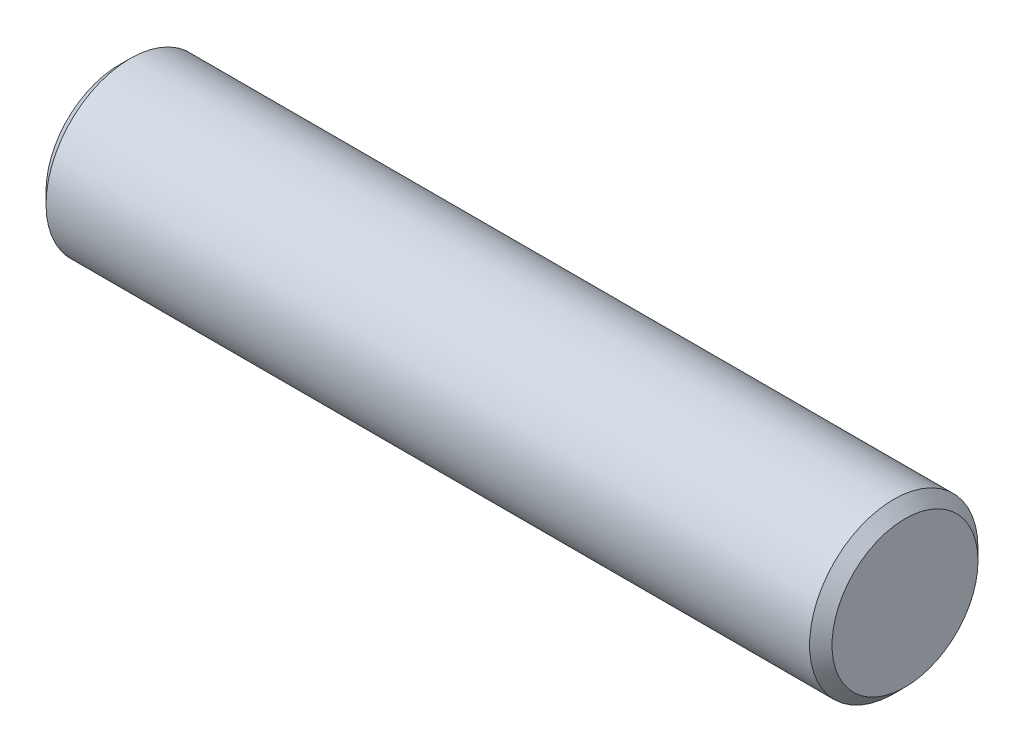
from build123d import *

# Parameters (mm, degrees)
ESQUISSE1_W     = 70
ESQUISSE1_H     = 7.5
CHANFREIN1_SIZE = 1


with BuildPart() as part:
    # Esquisse1 → Base-R_volution (revolve)
    with BuildSketch(Plane.XY, mode=Mode.PRIVATE) as base_r_volution_sk:
        with Locations((-35, 3.75)):
            Rectangle(ESQUISSE1_W, ESQUISSE1_H)
    revolve(base_r_volution_sk.sketch.rotate(Axis((40, 0, 0), (-1, 0, 0)), 90), axis=Axis((40, 0, 0), (-1, 0, 0)))

    # Chanfrein1
    chanfrein1_edges = [part.edges().sort_by_distance(p)[0] for p in [
        (-70, 0, 7.5),
        (0, 0, 7.5),
    ]]
    chamfer(chanfrein1_edges, length=CHANFREIN1_SIZE)


solid = part.part
